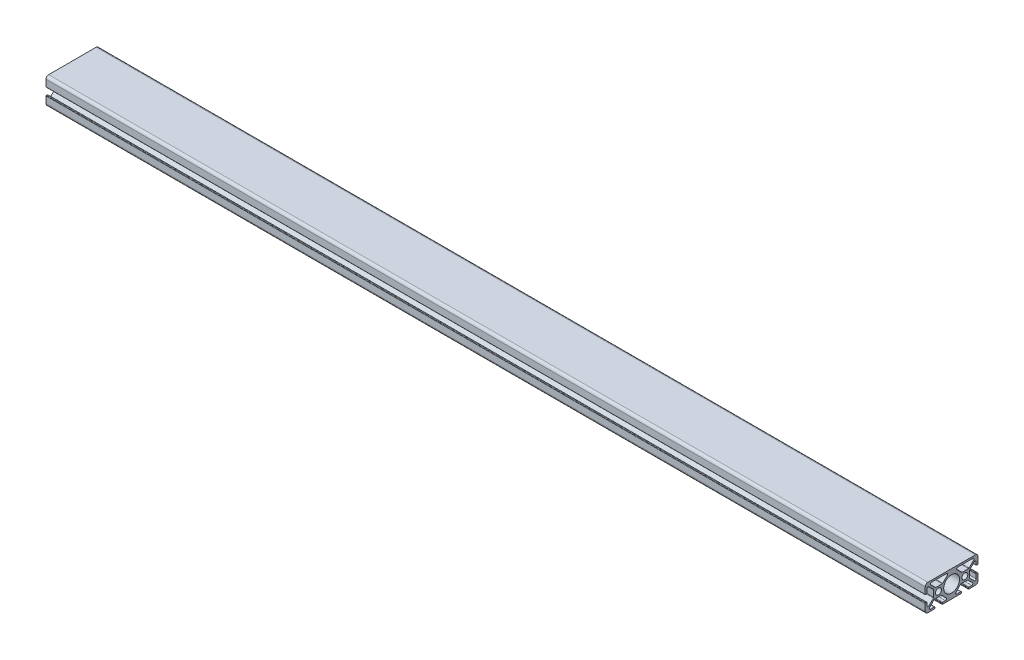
from build123d import *

# Parameters (mm, degrees)
MODEL_R                = 3.4
MODEL_R_2              = 9
STRUKTURBAUTEIL1_DEPTH = 1000


with BuildPart() as part:
    # Model → Strukturbauteil1 (new body)
    with BuildSketch(Plane(origin=(0, 0, 0), x_dir=(0, 0, -1), z_dir=(1, 0, 0))):
        with BuildLine():
            Line((-29.5, 4), (-28.5, 4))
            ThreePointArc((-28.5, 4), (-28.146446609, 4.146446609), (-28, 4.5))
            Line((-28, 4.5), (-28, 9.1022583))
            ThreePointArc((-28, 9.1022583), (-27.198882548, 10.301215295), (-25.784616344, 10.019900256))
            Line((-25.784616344, 10.019900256), (-20.692893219, 4.928177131))
            ThreePointArc((-20.692893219, 4.928177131), (-20.476120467, 4.603753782), (-20.4, 4.22107035))
            Line((-20.4, 4.22107035), (-20.4, -3.02107035))
            ThreePointArc((-20.4, -3.02107035), (-20.476120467, -3.403753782), (-20.692893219, -3.728177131))
            Line((-20.692893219, -3.728177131), (-25.784616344, -8.819900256))
            ThreePointArc((-25.784616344, -8.819900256), (-27.198882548, -9.101215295), (-28, -7.9022583))
            Line((-28, -7.9022583), (-28, -4.5))
            ThreePointArc((-28, -4.5), (-28.146446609, -4.146446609), (-28.5, -4))
            Line((-28.5, -4), (-29.5, -4))
            ThreePointArc((-29.5, -4), (-29.853553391, -4.146446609), (-30, -4.5))
            Line((-30, -4.5), (-30, -12))
            ThreePointArc((-30, -12), (-29.121320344, -14.121320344), (-27, -15))
            Line((-27, -15), (-19.5, -15))
            ThreePointArc((-19.5, -15), (-19.146446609, -14.853553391), (-19, -14.5))
            Line((-19, -14.5), (-19, -13.5))
            ThreePointArc((-19, -13.5), (-19.146446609, -13.146446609), (-19.5, -13))
            Line((-19.5, -13), (-24.1022583, -13))
            ThreePointArc((-24.1022583, -13), (-25.301215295, -12.198882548), (-25.019900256, -10.784616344))
            Line((-25.019900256, -10.784616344), (-19.928177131, -5.692893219))
            ThreePointArc((-19.928177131, -5.692893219), (-19.603753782, -5.476120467), (-19.22107035, -5.4))
            Line((-19.22107035, -5.4), (-11.97892965, -5.4))
            ThreePointArc((-11.97892965, -5.4), (-11.596246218, -5.476120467), (-11.271822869, -5.692893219))
            Line((-11.271822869, -5.692893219), (-6.180099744, -10.784616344))
            ThreePointArc((-6.180099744, -10.784616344), (-5.898784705, -12.198882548), (-7.0977417, -13))
            Line((-7.0977417, -13), (-10.5, -13))
            ThreePointArc((-10.5, -13), (-10.853553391, -13.146446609), (-11, -13.5))
            Line((-11, -13.5), (-11, -14.5))
            ThreePointArc((-11, -14.5), (-10.853553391, -14.853553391), (-10.5, -15))
            Line((-10.5, -15), (10.5, -15))
            ThreePointArc((10.5, -15), (10.853553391, -14.853553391), (11, -14.5))
            Line((11, -14.5), (11, -13.5))
            ThreePointArc((11, -13.5), (10.853553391, -13.146446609), (10.5, -13))
            Line((10.5, -13), (5.8977417, -13))
            ThreePointArc((5.8977417, -13), (4.698784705, -12.198882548), (4.980099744, -10.784616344))
            Line((4.980099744, -10.784616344), (10.071822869, -5.692893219))
            ThreePointArc((10.071822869, -5.692893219), (10.396246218, -5.476120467), (10.77892965, -5.4))
            Line((10.77892965, -5.4), (18.02107035, -5.4))
            ThreePointArc((18.02107035, -5.4), (18.403753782, -5.476120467), (18.728177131, -5.692893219))
            Line((18.728177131, -5.692893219), (23.819900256, -10.784616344))
            ThreePointArc((23.819900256, -10.784616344), (24.101215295, -12.198882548), (22.9022583, -13))
            Line((22.9022583, -13), (19.5, -13))
            ThreePointArc((19.5, -13), (19.146446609, -13.146446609), (19, -13.5))
            Line((19, -13.5), (19, -14.5))
            ThreePointArc((19, -14.5), (19.146446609, -14.853553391), (19.5, -15))
            Line((19.5, -15), (27, -15))
            ThreePointArc((27, -15), (29.121320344, -14.121320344), (30, -12))
            Line((30, -12), (30, -4.5))
            ThreePointArc((30, -4.5), (29.853553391, -4.146446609), (29.5, -4))
            Line((29.5, -4), (28.5, -4))
            ThreePointArc((28.5, -4), (28.146446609, -4.146446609), (28, -4.5))
            Line((28, -4.5), (28, -9.1022583))
            ThreePointArc((28, -9.1022583), (27.198882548, -10.301215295), (25.784616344, -10.019900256))
            Line((25.784616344, -10.019900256), (20.692893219, -4.928177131))
            ThreePointArc((20.692893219, -4.928177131), (20.476120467, -4.603753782), (20.4, -4.22107035))
            Line((20.4, -4.22107035), (20.4, 3.02107035))
            ThreePointArc((20.4, 3.02107035), (20.476120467, 3.403753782), (20.692893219, 3.728177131))
            Line((20.692893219, 3.728177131), (25.784616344, 8.819900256))
            ThreePointArc((25.784616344, 8.819900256), (27.198882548, 9.101215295), (28, 7.9022583))
            Line((28, 7.9022583), (28, 4.5))
            ThreePointArc((28, 4.5), (28.146446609, 4.146446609), (28.5, 4))
            Line((28.5, 4), (29.5, 4))
            ThreePointArc((29.5, 4), (29.853553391, 4.146446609), (30, 4.5))
            Line((30, 4.5), (30, 12))
            ThreePointArc((30, 12), (29.121320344, 14.121320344), (27, 15))
            Line((27, 15), (-27, 15))
            ThreePointArc((-27, 15), (-29.121320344, 14.121320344), (-30, 12))
            Line((-30, 12), (-30, 4.5))
            ThreePointArc((-30, 4.5), (-29.853553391, 4.146446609), (-29.5, 4))
        make_face()
        with Locations((-15, 0)):
            Circle(MODEL_R, mode=Mode.SUBTRACT)
        with Locations((15, 0)):
            Circle(MODEL_R, mode=Mode.SUBTRACT)
        Circle(MODEL_R_2, mode=Mode.SUBTRACT)
        with BuildLine():
            Line((25.019900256, 10.784616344), (19.928177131, 5.692893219))
            ThreePointArc((19.928177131, 5.692893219), (19.603753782, 5.476120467), (19.22107035, 5.4))
            Line((19.22107035, 5.4), (11.97892965, 5.4))
            ThreePointArc((11.97892965, 5.4), (11.596246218, 5.476120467), (11.271822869, 5.692893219))
            Line((11.271822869, 5.692893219), (6.180099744, 10.784616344))
            ThreePointArc((6.180099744, 10.784616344), (5.898784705, 12.198882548), (7.0977417, 13))
            Line((7.0977417, 13), (24.1022583, 13))
            ThreePointArc((24.1022583, 13), (25.301215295, 12.198882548), (25.019900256, 10.784616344))
        make_face(mode=Mode.SUBTRACT)
        with BuildLine():
            Line((-4.980099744, 10.784616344), (-10.071822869, 5.692893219))
            ThreePointArc((-10.071822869, 5.692893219), (-10.396246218, 5.476120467), (-10.77892965, 5.4))
            Line((-10.77892965, 5.4), (-18.02107035, 5.4))
            ThreePointArc((-18.02107035, 5.4), (-18.403753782, 5.476120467), (-18.728177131, 5.692893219))
            Line((-18.728177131, 5.692893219), (-23.819900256, 10.784616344))
            ThreePointArc((-23.819900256, 10.784616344), (-24.101215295, 12.198882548), (-22.9022583, 13))
            Line((-22.9022583, 13), (-5.8977417, 13))
            ThreePointArc((-5.8977417, 13), (-4.698784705, 12.198882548), (-4.980099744, 10.784616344))
        make_face(mode=Mode.SUBTRACT)
    extrude(amount=STRUKTURBAUTEIL1_DEPTH)


solid = part.part
